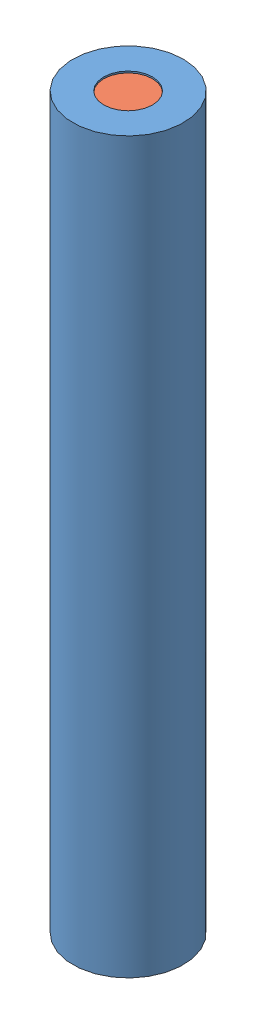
SolidWorks assembly 3B0076-2X.SLDASM, configuration Default (file format 7000). Lengths in mm.
Overall size (43.15 228.09 43.15).
3 component instances, 2 part files, 4 mates.
Components (placement in the parent):
- 3b0076-2XShrinkSkin-1: 3b0076-2XShrinkSkin.SLDPRT [Default] at origin size (34.54 228.09 34.54)
- ElectroChem3B0036-1: ElectroChem3B0036.SLDPRT [Default] at (0 0.508 0) size (33.5 111.4 33.5)
- ElectroChem3B0036-2: ElectroChem3B0036.SLDPRT [Default] at (0 116.184 0) x (0.35228 0 0.935895) z (-0.935895 0 0.35228) size (33.5 111.4 33.5)
Mates (geometry in assembly coordinates):
- Concentric1: concentric aligned: cylinder of 3b0076-2XShrinkSkin-1 through (0 0 0) axis (0 -1 0) radius 17.272; cylinder of ElectroChem3B0036-1 through (0 0.508 0) axis (0 -1 0) radius 16.75
- Concentric2: concentric aligned: cylinder of 3b0076-2XShrinkSkin-1 through (0 0 0) axis (0 -1 0) radius 17.272; cylinder of ElectroChem3B0036-2 through (0 116.184 0) axis (0 -1 0) radius 16.75
- Coincident1: coincident anti-aligned: plane of 3b0076-2XShrinkSkin-1 through (-16.764 227.584 0) normal (0 -1 0); plane of ElectroChem3B0036-2 through (0 227.584 0) normal (0 1 0)
- Coincident2: coincident anti-aligned: plane of 3b0076-2XShrinkSkin-1 through (-7.62 0.508 0) normal (0 1 0); plane of ElectroChem3B0036-1 through (-16.75 0.508 0) normal (0 -1 0)
